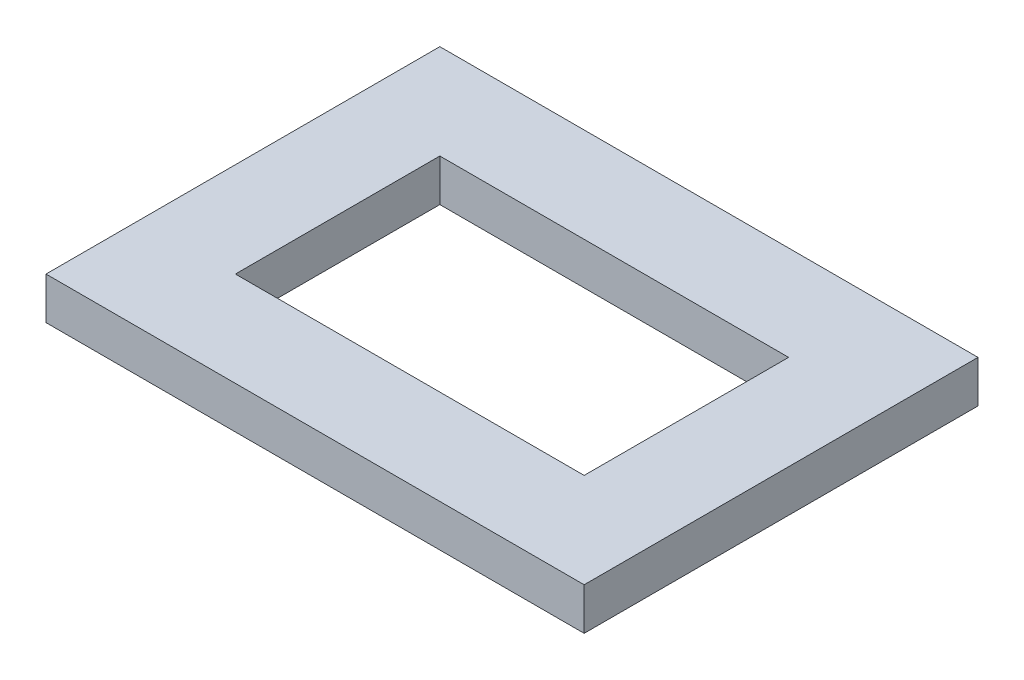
ISO-10303-21;
HEADER;
FILE_DESCRIPTION(('STEP AP214'),'2;1');
FILE_NAME('part.step','',(''),(''),'','','');
FILE_SCHEMA(('AUTOMOTIVE_DESIGN { 1 0 10303 214 1 1 1 1 }'));
ENDSEC;
DATA;
#1=APPLICATION_CONTEXT('core data for automotive mechanical design processes');
#2=APPLICATION_PROTOCOL_DEFINITION('international standard','automotive_design',2000,#1);
#3=PRODUCT_CONTEXT('',#1,'mechanical');
#4=PRODUCT('Part','Part','',(#3));
#5=PRODUCT_RELATED_PRODUCT_CATEGORY('part','',(#4));
#6=PRODUCT_DEFINITION_FORMATION('','',#4);
#7=PRODUCT_DEFINITION_CONTEXT('part definition',#1,'design');
#8=PRODUCT_DEFINITION('design','',#6,#7);
#9=PRODUCT_DEFINITION_SHAPE('','',#8);
#10=(LENGTH_UNIT() NAMED_UNIT(*) SI_UNIT(.MILLI.,.METRE.));
#11=(NAMED_UNIT(*) PLANE_ANGLE_UNIT() SI_UNIT($,.RADIAN.));
#12=(NAMED_UNIT(*) SI_UNIT($,.STERADIAN.) SOLID_ANGLE_UNIT());
#13=UNCERTAINTY_MEASURE_WITH_UNIT(LENGTH_MEASURE(1.E-05),#10,'distance_accuracy_value','');
#14=(GEOMETRIC_REPRESENTATION_CONTEXT(3) GLOBAL_UNCERTAINTY_ASSIGNED_CONTEXT((#13)) GLOBAL_UNIT_ASSIGNED_CONTEXT((#10,
#11,#12)) REPRESENTATION_CONTEXT('',''));
#15=CARTESIAN_POINT('',(0.,0.,0.));
#16=DIRECTION('',(0.,0.,1.));
#17=DIRECTION('',(1.,0.,0.));
#18=AXIS2_PLACEMENT_3D('',#15,#16,#17);
#19=CARTESIAN_POINT('',(0.,22.225,0.));
#20=DIRECTION('',(0.,1.,0.));
#21=DIRECTION('',(0.,0.,1.));
#22=AXIS2_PLACEMENT_3D('',#19,#20,#21);
#23=PLANE('',#22);
#24=DIRECTION('',(0.,0.,1.));
#25=VECTOR('',#24,1.);
#26=CARTESIAN_POINT('',(-142.075,22.225,103.975));
#27=LINE('',#26,#25);
#28=CARTESIAN_POINT('',(-142.075,22.225,-103.975));
#29=VERTEX_POINT('',#28);
#30=CARTESIAN_POINT('',(-142.075,22.225,103.975));
#31=VERTEX_POINT('',#30);
#32=EDGE_CURVE('E133',#29,#31,#27,.T.);
#33=ORIENTED_EDGE('',*,*,#32,.T.);
#34=DIRECTION('',(1.,0.,0.));
#35=VECTOR('',#34,1.);
#36=CARTESIAN_POINT('',(142.075,22.225,103.975));
#37=LINE('',#36,#35);
#38=CARTESIAN_POINT('',(142.075,22.225,103.975));
#39=VERTEX_POINT('',#38);
#40=EDGE_CURVE('E136',#31,#39,#37,.T.);
#41=ORIENTED_EDGE('',*,*,#40,.T.);
#42=DIRECTION('',(0.,0.,-1.));
#43=VECTOR('',#42,1.);
#44=CARTESIAN_POINT('',(142.075,22.225,103.975));
#45=LINE('',#44,#43);
#46=CARTESIAN_POINT('',(142.075,22.225,-103.975));
#47=VERTEX_POINT('',#46);
#48=EDGE_CURVE('E139',#39,#47,#45,.T.);
#49=ORIENTED_EDGE('',*,*,#48,.T.);
#50=DIRECTION('',(-1.,0.,0.));
#51=VECTOR('',#50,1.);
#52=CARTESIAN_POINT('',(142.075,22.225,-103.975));
#53=LINE('',#52,#51);
#54=EDGE_CURVE('E141',#47,#29,#53,.T.);
#55=ORIENTED_EDGE('',*,*,#54,.T.);
#56=EDGE_LOOP('',(#33,#41,#49,#55));
#57=FACE_BOUND('',#56,.T.);
#58=DIRECTION('',(1.,0.,0.));
#59=VECTOR('',#58,1.);
#60=CARTESIAN_POINT('',(92.075,22.225,53.975));
#61=LINE('',#60,#59);
#62=CARTESIAN_POINT('',(-92.075,22.225,53.975));
#63=VERTEX_POINT('',#62);
#64=CARTESIAN_POINT('',(92.075,22.225,53.975));
#65=VERTEX_POINT('',#64);
#66=EDGE_CURVE('E105',#63,#65,#61,.T.);
#67=ORIENTED_EDGE('',*,*,#66,.F.);
#68=DIRECTION('',(0.,0.,1.));
#69=VECTOR('',#68,1.);
#70=CARTESIAN_POINT('',(-92.075,22.225,53.975));
#71=LINE('',#70,#69);
#72=CARTESIAN_POINT('',(-92.075,22.225,-53.975));
#73=VERTEX_POINT('',#72);
#74=EDGE_CURVE('E97',#73,#63,#71,.T.);
#75=ORIENTED_EDGE('',*,*,#74,.F.);
#76=DIRECTION('',(-1.,0.,0.));
#77=VECTOR('',#76,1.);
#78=CARTESIAN_POINT('',(92.075,22.225,-53.975));
#79=LINE('',#78,#77);
#80=CARTESIAN_POINT('',(92.075,22.225,-53.975));
#81=VERTEX_POINT('',#80);
#82=EDGE_CURVE('E119',#81,#73,#79,.T.);
#83=ORIENTED_EDGE('',*,*,#82,.F.);
#84=DIRECTION('',(0.,0.,-1.));
#85=VECTOR('',#84,1.);
#86=CARTESIAN_POINT('',(92.075,22.225,53.975));
#87=LINE('',#86,#85);
#88=EDGE_CURVE('E117',#65,#81,#87,.T.);
#89=ORIENTED_EDGE('',*,*,#88,.F.);
#90=EDGE_LOOP('',(#67,#75,#83,#89));
#91=FACE_BOUND('',#90,.T.);
#92=ADVANCED_FACE('F32',(#57,#91),#23,.T.);
#93=CARTESIAN_POINT('',(0.,0.,0.));
#94=DIRECTION('',(0.,1.,0.));
#95=DIRECTION('',(0.,0.,1.));
#96=AXIS2_PLACEMENT_3D('',#93,#94,#95);
#97=PLANE('',#96);
#98=DIRECTION('',(0.,0.,1.));
#99=VECTOR('',#98,1.);
#100=CARTESIAN_POINT('',(-142.075,0.,103.975));
#101=LINE('',#100,#99);
#102=CARTESIAN_POINT('',(-142.075,0.,-103.975));
#103=VERTEX_POINT('',#102);
#104=CARTESIAN_POINT('',(-142.075,0.,103.975));
#105=VERTEX_POINT('',#104);
#106=EDGE_CURVE('E113',#103,#105,#101,.T.);
#107=ORIENTED_EDGE('',*,*,#106,.F.);
#108=DIRECTION('',(-1.,0.,0.));
#109=VECTOR('',#108,1.);
#110=CARTESIAN_POINT('',(142.075,0.,-103.975));
#111=LINE('',#110,#109);
#112=CARTESIAN_POINT('',(142.075,0.,-103.975));
#113=VERTEX_POINT('',#112);
#114=EDGE_CURVE('E137',#113,#103,#111,.T.);
#115=ORIENTED_EDGE('',*,*,#114,.F.);
#116=DIRECTION('',(0.,0.,-1.));
#117=VECTOR('',#116,1.);
#118=CARTESIAN_POINT('',(142.075,0.,103.975));
#119=LINE('',#118,#117);
#120=CARTESIAN_POINT('',(142.075,0.,103.975));
#121=VERTEX_POINT('',#120);
#122=EDGE_CURVE('E148',#121,#113,#119,.T.);
#123=ORIENTED_EDGE('',*,*,#122,.F.);
#124=DIRECTION('',(1.,0.,0.));
#125=VECTOR('',#124,1.);
#126=CARTESIAN_POINT('',(142.075,0.,103.975));
#127=LINE('',#126,#125);
#128=EDGE_CURVE('E146',#105,#121,#127,.T.);
#129=ORIENTED_EDGE('',*,*,#128,.F.);
#130=EDGE_LOOP('',(#107,#115,#123,#129));
#131=FACE_BOUND('',#130,.T.);
#132=DIRECTION('',(0.,0.,1.));
#133=VECTOR('',#132,1.);
#134=CARTESIAN_POINT('',(-92.075,0.,53.975));
#135=LINE('',#134,#133);
#136=CARTESIAN_POINT('',(-92.075,0.,-53.975));
#137=VERTEX_POINT('',#136);
#138=CARTESIAN_POINT('',(-92.075,0.,53.975));
#139=VERTEX_POINT('',#138);
#140=EDGE_CURVE('E55',#137,#139,#135,.T.);
#141=ORIENTED_EDGE('',*,*,#140,.T.);
#142=DIRECTION('',(1.,0.,0.));
#143=VECTOR('',#142,1.);
#144=CARTESIAN_POINT('',(92.075,0.,53.975));
#145=LINE('',#144,#143);
#146=CARTESIAN_POINT('',(92.075,0.,53.975));
#147=VERTEX_POINT('',#146);
#148=EDGE_CURVE('E112',#139,#147,#145,.T.);
#149=ORIENTED_EDGE('',*,*,#148,.T.);
#150=DIRECTION('',(0.,0.,-1.));
#151=VECTOR('',#150,1.);
#152=CARTESIAN_POINT('',(92.075,0.,53.975));
#153=LINE('',#152,#151);
#154=CARTESIAN_POINT('',(92.075,0.,-53.975));
#155=VERTEX_POINT('',#154);
#156=EDGE_CURVE('E125',#147,#155,#153,.T.);
#157=ORIENTED_EDGE('',*,*,#156,.T.);
#158=DIRECTION('',(-1.,0.,0.));
#159=VECTOR('',#158,1.);
#160=CARTESIAN_POINT('',(92.075,0.,-53.975));
#161=LINE('',#160,#159);
#162=EDGE_CURVE('E106',#155,#137,#161,.T.);
#163=ORIENTED_EDGE('',*,*,#162,.T.);
#164=EDGE_LOOP('',(#141,#149,#157,#163));
#165=FACE_BOUND('',#164,.T.);
#166=ADVANCED_FACE('F166',(#131,#165),#97,.F.);
#167=CARTESIAN_POINT('',(-142.075,22.225,103.975));
#168=DIRECTION('',(1.,0.,0.));
#169=DIRECTION('',(0.,0.,-1.));
#170=AXIS2_PLACEMENT_3D('',#167,#168,#169);
#171=PLANE('',#170);
#172=ORIENTED_EDGE('',*,*,#106,.T.);
#173=DIRECTION('',(0.,-1.,0.));
#174=VECTOR('',#173,1.);
#175=CARTESIAN_POINT('',(-142.075,22.225,103.975));
#176=LINE('',#175,#174);
#177=EDGE_CURVE('E11',#31,#105,#176,.T.);
#178=ORIENTED_EDGE('',*,*,#177,.F.);
#179=ORIENTED_EDGE('',*,*,#32,.F.);
#180=DIRECTION('',(0.,-1.,0.));
#181=VECTOR('',#180,1.);
#182=CARTESIAN_POINT('',(-142.075,22.225,-103.975));
#183=LINE('',#182,#181);
#184=EDGE_CURVE('E143',#29,#103,#183,.T.);
#185=ORIENTED_EDGE('',*,*,#184,.T.);
#186=EDGE_LOOP('',(#172,#178,#179,#185));
#187=FACE_BOUND('',#186,.T.);
#188=ADVANCED_FACE('F34',(#187),#171,.F.);
#189=CARTESIAN_POINT('',(142.075,22.225,103.975));
#190=DIRECTION('',(0.,0.,-1.));
#191=DIRECTION('',(-1.,0.,0.));
#192=AXIS2_PLACEMENT_3D('',#189,#190,#191);
#193=PLANE('',#192);
#194=ORIENTED_EDGE('',*,*,#128,.T.);
#195=DIRECTION('',(0.,-1.,0.));
#196=VECTOR('',#195,1.);
#197=CARTESIAN_POINT('',(142.075,22.225,103.975));
#198=LINE('',#197,#196);
#199=EDGE_CURVE('E40',#39,#121,#198,.T.);
#200=ORIENTED_EDGE('',*,*,#199,.F.);
#201=ORIENTED_EDGE('',*,*,#40,.F.);
#202=ORIENTED_EDGE('',*,*,#177,.T.);
#203=EDGE_LOOP('',(#194,#200,#201,#202));
#204=FACE_BOUND('',#203,.T.);
#205=ADVANCED_FACE('F176',(#204),#193,.F.);
#206=CARTESIAN_POINT('',(142.075,22.225,103.975));
#207=DIRECTION('',(-1.,0.,0.));
#208=DIRECTION('',(0.,0.,1.));
#209=AXIS2_PLACEMENT_3D('',#206,#207,#208);
#210=PLANE('',#209);
#211=ORIENTED_EDGE('',*,*,#122,.T.);
#212=DIRECTION('',(0.,-1.,0.));
#213=VECTOR('',#212,1.);
#214=CARTESIAN_POINT('',(142.075,22.225,-103.975));
#215=LINE('',#214,#213);
#216=EDGE_CURVE('E153',#47,#113,#215,.T.);
#217=ORIENTED_EDGE('',*,*,#216,.F.);
#218=ORIENTED_EDGE('',*,*,#48,.F.);
#219=ORIENTED_EDGE('',*,*,#199,.T.);
#220=EDGE_LOOP('',(#211,#217,#218,#219));
#221=FACE_BOUND('',#220,.T.);
#222=ADVANCED_FACE('F160',(#221),#210,.F.);
#223=CARTESIAN_POINT('',(142.075,22.225,-103.975));
#224=DIRECTION('',(0.,0.,1.));
#225=DIRECTION('',(1.,0.,0.));
#226=AXIS2_PLACEMENT_3D('',#223,#224,#225);
#227=PLANE('',#226);
#228=ORIENTED_EDGE('',*,*,#114,.T.);
#229=ORIENTED_EDGE('',*,*,#184,.F.);
#230=ORIENTED_EDGE('',*,*,#54,.F.);
#231=ORIENTED_EDGE('',*,*,#216,.T.);
#232=EDGE_LOOP('',(#228,#229,#230,#231));
#233=FACE_BOUND('',#232,.T.);
#234=ADVANCED_FACE('F170',(#233),#227,.F.);
#235=CARTESIAN_POINT('',(-92.075,22.225,53.975));
#236=DIRECTION('',(1.,0.,0.));
#237=DIRECTION('',(0.,0.,-1.));
#238=AXIS2_PLACEMENT_3D('',#235,#236,#237);
#239=PLANE('',#238);
#240=ORIENTED_EDGE('',*,*,#140,.F.);
#241=DIRECTION('',(0.,-1.,0.));
#242=VECTOR('',#241,1.);
#243=CARTESIAN_POINT('',(-92.075,22.225,-53.975));
#244=LINE('',#243,#242);
#245=EDGE_CURVE('E101',#73,#137,#244,.T.);
#246=ORIENTED_EDGE('',*,*,#245,.F.);
#247=ORIENTED_EDGE('',*,*,#74,.T.);
#248=DIRECTION('',(0.,-1.,0.));
#249=VECTOR('',#248,1.);
#250=CARTESIAN_POINT('',(-92.075,22.225,53.975));
#251=LINE('',#250,#249);
#252=EDGE_CURVE('E100',#63,#139,#251,.T.);
#253=ORIENTED_EDGE('',*,*,#252,.T.);
#254=EDGE_LOOP('',(#240,#246,#247,#253));
#255=FACE_BOUND('',#254,.T.);
#256=ADVANCED_FACE('F99',(#255),#239,.T.);
#257=CARTESIAN_POINT('',(92.075,22.225,53.975));
#258=DIRECTION('',(0.,0.,-1.));
#259=DIRECTION('',(-1.,0.,0.));
#260=AXIS2_PLACEMENT_3D('',#257,#258,#259);
#261=PLANE('',#260);
#262=ORIENTED_EDGE('',*,*,#148,.F.);
#263=ORIENTED_EDGE('',*,*,#252,.F.);
#264=ORIENTED_EDGE('',*,*,#66,.T.);
#265=DIRECTION('',(0.,-1.,0.));
#266=VECTOR('',#265,1.);
#267=CARTESIAN_POINT('',(92.075,22.225,53.975));
#268=LINE('',#267,#266);
#269=EDGE_CURVE('E114',#65,#147,#268,.T.);
#270=ORIENTED_EDGE('',*,*,#269,.T.);
#271=EDGE_LOOP('',(#262,#263,#264,#270));
#272=FACE_BOUND('',#271,.T.);
#273=ADVANCED_FACE('F109',(#272),#261,.T.);
#274=CARTESIAN_POINT('',(92.075,22.225,53.975));
#275=DIRECTION('',(-1.,0.,0.));
#276=DIRECTION('',(0.,0.,1.));
#277=AXIS2_PLACEMENT_3D('',#274,#275,#276);
#278=PLANE('',#277);
#279=ORIENTED_EDGE('',*,*,#156,.F.);
#280=ORIENTED_EDGE('',*,*,#269,.F.);
#281=ORIENTED_EDGE('',*,*,#88,.T.);
#282=DIRECTION('',(0.,-1.,0.));
#283=VECTOR('',#282,1.);
#284=CARTESIAN_POINT('',(92.075,22.225,-53.975));
#285=LINE('',#284,#283);
#286=EDGE_CURVE('E47',#81,#155,#285,.T.);
#287=ORIENTED_EDGE('',*,*,#286,.T.);
#288=EDGE_LOOP('',(#279,#280,#281,#287));
#289=FACE_BOUND('',#288,.T.);
#290=ADVANCED_FACE('F199',(#289),#278,.T.);
#291=CARTESIAN_POINT('',(92.075,22.225,-53.975));
#292=DIRECTION('',(0.,0.,1.));
#293=DIRECTION('',(1.,0.,0.));
#294=AXIS2_PLACEMENT_3D('',#291,#292,#293);
#295=PLANE('',#294);
#296=ORIENTED_EDGE('',*,*,#162,.F.);
#297=ORIENTED_EDGE('',*,*,#286,.F.);
#298=ORIENTED_EDGE('',*,*,#82,.T.);
#299=ORIENTED_EDGE('',*,*,#245,.T.);
#300=EDGE_LOOP('',(#296,#297,#298,#299));
#301=FACE_BOUND('',#300,.T.);
#302=ADVANCED_FACE('F203',(#301),#295,.T.);
#303=CLOSED_SHELL('',(#92,#166,#188,#205,#222,#234,#256,#273,#290,#302));
#304=MANIFOLD_SOLID_BREP('B2',#303);
#305=ADVANCED_BREP_SHAPE_REPRESENTATION('',(#18,#304),#14);
#306=SHAPE_DEFINITION_REPRESENTATION(#9,#305);
ENDSEC;
END-ISO-10303-21;
